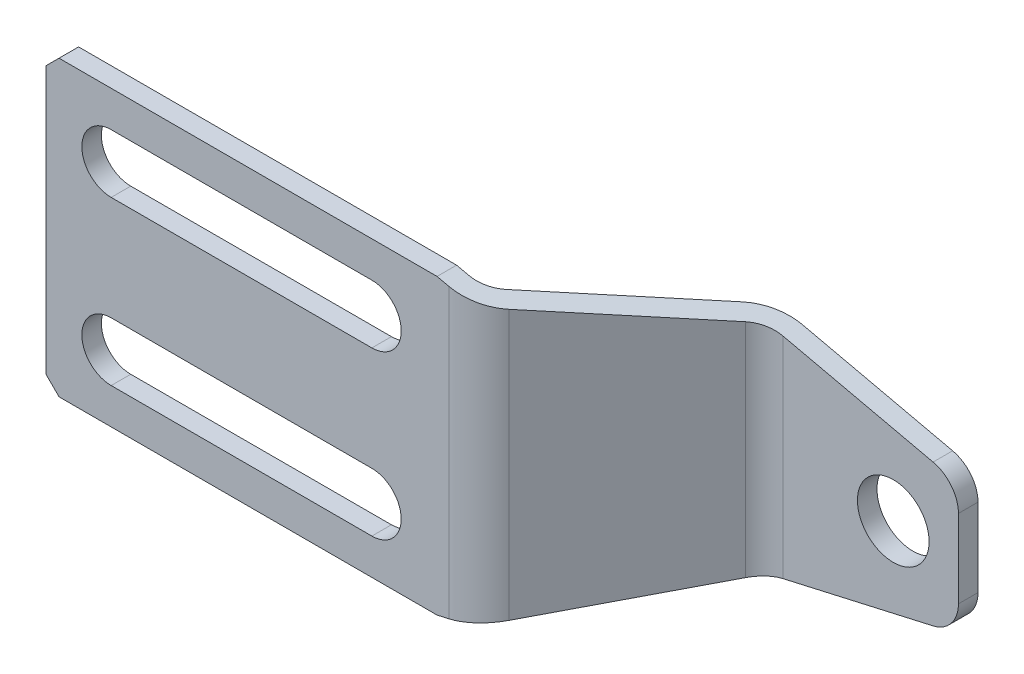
ISO-10303-21;
HEADER;
FILE_DESCRIPTION(('STEP AP214'),'2;1');
FILE_NAME('part.step','',(''),(''),'','','');
FILE_SCHEMA(('AUTOMOTIVE_DESIGN { 1 0 10303 214 1 1 1 1 }'));
ENDSEC;
DATA;
#1=APPLICATION_CONTEXT('core data for automotive mechanical design processes');
#2=APPLICATION_PROTOCOL_DEFINITION('international standard','automotive_design',2000,#1);
#3=PRODUCT_CONTEXT('',#1,'mechanical');
#4=PRODUCT('Part','Part','',(#3));
#5=PRODUCT_RELATED_PRODUCT_CATEGORY('part','',(#4));
#6=PRODUCT_DEFINITION_FORMATION('','',#4);
#7=PRODUCT_DEFINITION_CONTEXT('part definition',#1,'design');
#8=PRODUCT_DEFINITION('design','',#6,#7);
#9=PRODUCT_DEFINITION_SHAPE('','',#8);
#10=(LENGTH_UNIT() NAMED_UNIT(*) SI_UNIT(.MILLI.,.METRE.));
#11=(NAMED_UNIT(*) PLANE_ANGLE_UNIT() SI_UNIT($,.RADIAN.));
#12=(NAMED_UNIT(*) SI_UNIT($,.STERADIAN.) SOLID_ANGLE_UNIT());
#13=UNCERTAINTY_MEASURE_WITH_UNIT(LENGTH_MEASURE(1.E-05),#10,'distance_accuracy_value','');
#14=(GEOMETRIC_REPRESENTATION_CONTEXT(3) GLOBAL_UNCERTAINTY_ASSIGNED_CONTEXT((#13)) GLOBAL_UNIT_ASSIGNED_CONTEXT((#10,
#11,#12)) REPRESENTATION_CONTEXT('',''));
#15=CARTESIAN_POINT('',(0.,0.,0.));
#16=DIRECTION('',(0.,0.,1.));
#17=DIRECTION('',(1.,0.,0.));
#18=AXIS2_PLACEMENT_3D('',#15,#16,#17);
#19=CARTESIAN_POINT('',(95.,12.5000000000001,-75.));
#20=DIRECTION('',(0.,0.,1.));
#21=DIRECTION('',(0.,-1.,0.));
#22=AXIS2_PLACEMENT_3D('',#19,#20,#21);
#23=CYLINDRICAL_SURFACE('',#22,5.5);
#24=CARTESIAN_POINT('',(95.,12.5000000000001,-22.));
#25=DIRECTION('',(0.,0.,-1.));
#26=DIRECTION('',(1.,0.,0.));
#27=AXIS2_PLACEMENT_3D('',#24,#25,#26);
#28=CIRCLE('',#27,5.5);
#29=CARTESIAN_POINT('',(100.5,12.5000000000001,-22.));
#30=VERTEX_POINT('',#29);
#31=EDGE_CURVE('E270',#30,#30,#28,.F.);
#32=ORIENTED_EDGE('',*,*,#31,.T.);
#33=EDGE_LOOP('',(#32));
#34=FACE_BOUND('',#33,.T.);
#35=CARTESIAN_POINT('',(95.,12.5000000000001,-25.));
#36=DIRECTION('',(0.,0.,-1.));
#37=DIRECTION('',(1.,0.,0.));
#38=AXIS2_PLACEMENT_3D('',#35,#36,#37);
#39=CIRCLE('',#38,5.5);
#40=CARTESIAN_POINT('',(100.5,12.5000000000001,-25.));
#41=VERTEX_POINT('',#40);
#42=EDGE_CURVE('E278',#41,#41,#39,.F.);
#43=ORIENTED_EDGE('',*,*,#42,.F.);
#44=EDGE_LOOP('',(#43));
#45=FACE_BOUND('',#44,.T.);
#46=ADVANCED_FACE('F14',(#34,#45),#23,.F.);
#47=CARTESIAN_POINT('',(-10.,52.5,0.));
#48=DIRECTION('',(0.,0.,-1.));
#49=DIRECTION('',(0.,1.,0.));
#50=AXIS2_PLACEMENT_3D('',#47,#48,#49);
#51=PLANE('',#50);
#52=CARTESIAN_POINT('',(40.,25.,0.));
#53=DIRECTION('',(0.,0.,-1.));
#54=DIRECTION('',(0.,1.,0.));
#55=AXIS2_PLACEMENT_3D('',#52,#53,#54);
#56=CIRCLE('',#55,4.5);
#57=CARTESIAN_POINT('',(40.,20.5,0.));
#58=VERTEX_POINT('',#57);
#59=CARTESIAN_POINT('',(40.,29.5,0.));
#60=VERTEX_POINT('',#59);
#61=EDGE_CURVE('E299',#58,#60,#56,.F.);
#62=ORIENTED_EDGE('',*,*,#61,.T.);
#63=DIRECTION('',(-1.,0.,0.));
#64=VECTOR('',#63,1.);
#65=CARTESIAN_POINT('',(40.,29.5,0.));
#66=LINE('',#65,#64);
#67=CARTESIAN_POINT('',(0.,29.5,0.));
#68=VERTEX_POINT('',#67);
#69=EDGE_CURVE('E358',#60,#68,#66,.T.);
#70=ORIENTED_EDGE('',*,*,#69,.T.);
#71=CARTESIAN_POINT('',(0.,25.,0.));
#72=DIRECTION('',(0.,0.,-1.));
#73=DIRECTION('',(0.,1.,0.));
#74=AXIS2_PLACEMENT_3D('',#71,#72,#73);
#75=CIRCLE('',#74,4.5);
#76=CARTESIAN_POINT('',(0.,20.5,0.));
#77=VERTEX_POINT('',#76);
#78=EDGE_CURVE('E295',#68,#77,#75,.F.);
#79=ORIENTED_EDGE('',*,*,#78,.T.);
#80=DIRECTION('',(1.,0.,0.));
#81=VECTOR('',#80,1.);
#82=CARTESIAN_POINT('',(40.,20.5,0.));
#83=LINE('',#82,#81);
#84=EDGE_CURVE('E297',#77,#58,#83,.T.);
#85=ORIENTED_EDGE('',*,*,#84,.T.);
#86=EDGE_LOOP('',(#62,#70,#79,#85));
#87=FACE_BOUND('',#86,.T.);
#88=DIRECTION('',(-1.,0.,0.));
#89=VECTOR('',#88,1.);
#90=CARTESIAN_POINT('',(-8.,35.,0.));
#91=LINE('',#90,#89);
#92=CARTESIAN_POINT('',(50.,35.,0.));
#93=VERTEX_POINT('',#92);
#94=CARTESIAN_POINT('',(-8.,35.,0.));
#95=VERTEX_POINT('',#94);
#96=EDGE_CURVE('E320',#93,#95,#91,.T.);
#97=ORIENTED_EDGE('',*,*,#96,.F.);
#98=DIRECTION('',(-0.97513285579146,0.221621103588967,0.));
#99=VECTOR('',#98,1.);
#100=CARTESIAN_POINT('',(50.,35.,0.));
#101=LINE('',#100,#99);
#102=CARTESIAN_POINT('',(51.8278760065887,34.5845736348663,0.));
#103=VERTEX_POINT('',#102);
#104=EDGE_CURVE('E317',#103,#93,#101,.T.);
#105=ORIENTED_EDGE('',*,*,#104,.F.);
#106=DIRECTION('',(0.,-1.,0.));
#107=VECTOR('',#106,1.);
#108=CARTESIAN_POINT('',(51.8278760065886,52.5,0.));
#109=LINE('',#108,#107);
#110=CARTESIAN_POINT('',(51.8278760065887,-9.58457363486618,0.));
#111=VERTEX_POINT('',#110);
#112=EDGE_CURVE('E281',#103,#111,#109,.T.);
#113=ORIENTED_EDGE('',*,*,#112,.T.);
#114=DIRECTION('',(0.975132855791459,0.221621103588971,0.));
#115=VECTOR('',#114,1.);
#116=CARTESIAN_POINT('',(50.0000000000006,-10.,0.));
#117=LINE('',#116,#115);
#118=CARTESIAN_POINT('',(50.0000000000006,-10.,0.));
#119=VERTEX_POINT('',#118);
#120=EDGE_CURVE('E315',#119,#111,#117,.T.);
#121=ORIENTED_EDGE('',*,*,#120,.F.);
#122=DIRECTION('',(1.,0.,0.));
#123=VECTOR('',#122,1.);
#124=CARTESIAN_POINT('',(-8.,-10.,0.));
#125=LINE('',#124,#123);
#126=CARTESIAN_POINT('',(-8.,-10.,0.));
#127=VERTEX_POINT('',#126);
#128=EDGE_CURVE('E312',#127,#119,#125,.T.);
#129=ORIENTED_EDGE('',*,*,#128,.F.);
#130=DIRECTION('',(0.707106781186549,-0.707106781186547,0.));
#131=VECTOR('',#130,1.);
#132=CARTESIAN_POINT('',(-10.,-8.,0.));
#133=LINE('',#132,#131);
#134=CARTESIAN_POINT('',(-10.,-8.,0.));
#135=VERTEX_POINT('',#134);
#136=EDGE_CURVE('E309',#135,#127,#133,.T.);
#137=ORIENTED_EDGE('',*,*,#136,.F.);
#138=DIRECTION('',(0.,-1.,0.));
#139=VECTOR('',#138,1.);
#140=CARTESIAN_POINT('',(-10.,52.5,0.));
#141=LINE('',#140,#139);
#142=CARTESIAN_POINT('',(-10.,33.,0.));
#143=VERTEX_POINT('',#142);
#144=EDGE_CURVE('E275',#143,#135,#141,.T.);
#145=ORIENTED_EDGE('',*,*,#144,.F.);
#146=DIRECTION('',(-0.707106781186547,-0.707106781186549,0.));
#147=VECTOR('',#146,1.);
#148=CARTESIAN_POINT('',(-8.,35.,0.));
#149=LINE('',#148,#147);
#150=EDGE_CURVE('E323',#95,#143,#149,.T.);
#151=ORIENTED_EDGE('',*,*,#150,.F.);
#152=EDGE_LOOP('',(#97,#105,#113,#121,#129,#137,#145,#151));
#153=FACE_BOUND('',#152,.T.);
#154=CARTESIAN_POINT('',(40.,0.,0.));
#155=DIRECTION('',(0.,0.,-1.));
#156=DIRECTION('',(0.,1.,0.));
#157=AXIS2_PLACEMENT_3D('',#154,#155,#156);
#158=CIRCLE('',#157,4.5);
#159=CARTESIAN_POINT('',(40.,-4.49999999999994,0.));
#160=VERTEX_POINT('',#159);
#161=CARTESIAN_POINT('',(40.,4.50000000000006,0.));
#162=VERTEX_POINT('',#161);
#163=EDGE_CURVE('E307',#160,#162,#158,.F.);
#164=ORIENTED_EDGE('',*,*,#163,.T.);
#165=DIRECTION('',(-1.,0.,0.));
#166=VECTOR('',#165,1.);
#167=CARTESIAN_POINT('',(40.,4.50000000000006,0.));
#168=LINE('',#167,#166);
#169=CARTESIAN_POINT('',(0.,4.5,0.));
#170=VERTEX_POINT('',#169);
#171=EDGE_CURVE('E301',#162,#170,#168,.T.);
#172=ORIENTED_EDGE('',*,*,#171,.T.);
#173=CARTESIAN_POINT('',(0.,0.,0.));
#174=DIRECTION('',(0.,0.,-1.));
#175=DIRECTION('',(0.,1.,0.));
#176=AXIS2_PLACEMENT_3D('',#173,#174,#175);
#177=CIRCLE('',#176,4.5);
#178=CARTESIAN_POINT('',(0.,-4.5,0.));
#179=VERTEX_POINT('',#178);
#180=EDGE_CURVE('E303',#170,#179,#177,.F.);
#181=ORIENTED_EDGE('',*,*,#180,.T.);
#182=DIRECTION('',(1.,0.,0.));
#183=VECTOR('',#182,1.);
#184=CARTESIAN_POINT('',(40.,-4.49999999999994,0.));
#185=LINE('',#184,#183);
#186=EDGE_CURVE('E305',#179,#160,#185,.T.);
#187=ORIENTED_EDGE('',*,*,#186,.T.);
#188=EDGE_LOOP('',(#164,#172,#181,#187));
#189=FACE_BOUND('',#188,.T.);
#190=ADVANCED_FACE('F447',(#87,#153,#189),#51,.T.);
#191=CARTESIAN_POINT('',(51.8278760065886,52.5,-5.));
#192=DIRECTION('',(0.,-1.,0.));
#193=DIRECTION('',(0.,0.,-1.));
#194=AXIS2_PLACEMENT_3D('',#191,#192,#193);
#195=CYLINDRICAL_SURFACE('',#194,5.);
#196=DIRECTION('',(0.,-1.,0.));
#197=VECTOR('',#196,1.);
#198=CARTESIAN_POINT('',(55.7322200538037,52.5,-1.8765247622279));
#199=LINE('',#198,#197);
#200=CARTESIAN_POINT('',(55.7322200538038,33.6972227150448,-1.8765247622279));
#201=VERTEX_POINT('',#200);
#202=CARTESIAN_POINT('',(55.7322200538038,-8.69722271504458,-1.8765247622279));
#203=VERTEX_POINT('',#202);
#204=EDGE_CURVE('E279',#201,#203,#199,.T.);
#205=ORIENTED_EDGE('',*,*,#204,.T.);
#206=CARTESIAN_POINT('',(51.8278760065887,-9.58457363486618,-5.));
#207=DIRECTION('',(0.221621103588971,-0.97513285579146,0.));
#208=DIRECTION('',(-0.975132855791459,-0.221621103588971,0.));
#209=AXIS2_PLACEMENT_3D('',#206,#207,#208);
#210=ELLIPSE('',#209,5.12750644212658,5.);
#211=EDGE_CURVE('E193',#111,#203,#210,.F.);
#212=ORIENTED_EDGE('',*,*,#211,.F.);
#213=ORIENTED_EDGE('',*,*,#112,.F.);
#214=CARTESIAN_POINT('',(51.8278760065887,34.5845736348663,-5.));
#215=DIRECTION('',(0.221621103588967,0.97513285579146,0.));
#216=DIRECTION('',(0.97513285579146,-0.221621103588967,0.));
#217=AXIS2_PLACEMENT_3D('',#214,#215,#216);
#218=ELLIPSE('',#217,5.12750644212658,5.);
#219=EDGE_CURVE('E326',#201,#103,#218,.F.);
#220=ORIENTED_EDGE('',*,*,#219,.F.);
#221=EDGE_LOOP('',(#205,#212,#213,#220));
#222=FACE_BOUND('',#221,.T.);
#223=ADVANCED_FACE('F454',(#222),#195,.F.);
#224=CARTESIAN_POINT('',(71.7689997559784,52.5,-21.9224993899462));
#225=DIRECTION('',(-0.78086880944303,0.,-0.624695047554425));
#226=DIRECTION('',(0.624695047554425,0.,-0.78086880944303));
#227=AXIS2_PLACEMENT_3D('',#224,#225,#226);
#228=PLANE('',#227);
#229=DIRECTION('',(0.,-1.,0.));
#230=VECTOR('',#229,1.);
#231=CARTESIAN_POINT('',(71.8290485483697,35.,-21.9975603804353));
#232=LINE('',#231,#230);
#233=CARTESIAN_POINT('',(71.8290485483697,30.0388526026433,-21.9975603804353));
#234=VERTEX_POINT('',#233);
#235=CARTESIAN_POINT('',(71.8290485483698,-5.03885260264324,-21.9975603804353));
#236=VERTEX_POINT('',#235);
#237=EDGE_CURVE('E203',#234,#236,#232,.T.);
#238=ORIENTED_EDGE('',*,*,#237,.T.);
#239=DIRECTION('',(0.618492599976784,0.140566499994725,-0.77311574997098));
#240=VECTOR('',#239,1.);
#241=CARTESIAN_POINT('',(88.3913803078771,-1.27468629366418,-42.7004750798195));
#242=LINE('',#241,#240);
#243=EDGE_CURVE('E187',#203,#236,#242,.T.);
#244=ORIENTED_EDGE('',*,*,#243,.F.);
#245=ORIENTED_EDGE('',*,*,#204,.F.);
#246=DIRECTION('',(-0.618492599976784,0.140566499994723,0.77311574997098));
#247=VECTOR('',#246,1.);
#248=CARTESIAN_POINT('',(88.3913803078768,26.2746862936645,-42.7004750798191));
#249=LINE('',#248,#247);
#250=EDGE_CURVE('E208',#234,#201,#249,.T.);
#251=ORIENTED_EDGE('',*,*,#250,.F.);
#252=EDGE_LOOP('',(#238,#244,#245,#251));
#253=FACE_BOUND('',#252,.T.);
#254=ADVANCED_FACE('F207',(#253),#228,.T.);
#255=CARTESIAN_POINT('',(78.1721239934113,52.5,-25.));
#256=DIRECTION('',(0.,0.,-1.));
#257=DIRECTION('',(1.,0.,0.));
#258=AXIS2_PLACEMENT_3D('',#255,#256,#257);
#259=PLANE('',#258);
#260=DIRECTION('',(0.975132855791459,0.221621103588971,0.));
#261=VECTOR('',#260,1.);
#262=CARTESIAN_POINT('',(50.0000000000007,-10.,-25.));
#263=LINE('',#262,#261);
#264=CARTESIAN_POINT('',(78.0759990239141,-3.61909113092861,-25.));
#265=VERTEX_POINT('',#264);
#266=CARTESIAN_POINT('',(101.108105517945,1.61547852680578,-25.));
#267=VERTEX_POINT('',#266);
#268=EDGE_CURVE('E286',#265,#267,#263,.T.);
#269=ORIENTED_EDGE('',*,*,#268,.F.);
#270=DIRECTION('',(0.,-1.,0.));
#271=VECTOR('',#270,1.);
#272=CARTESIAN_POINT('',(78.075999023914,35.,-25.));
#273=LINE('',#272,#271);
#274=CARTESIAN_POINT('',(78.075999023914,28.6190911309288,-25.));
#275=VERTEX_POINT('',#274);
#276=EDGE_CURVE('E205',#275,#265,#273,.T.);
#277=ORIENTED_EDGE('',*,*,#276,.F.);
#278=DIRECTION('',(-0.97513285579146,0.221621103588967,0.));
#279=VECTOR('',#278,1.);
#280=CARTESIAN_POINT('',(50.,35.,-25.));
#281=LINE('',#280,#279);
#282=CARTESIAN_POINT('',(101.108105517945,23.3845214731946,-25.));
#283=VERTEX_POINT('',#282);
#284=EDGE_CURVE('E28',#283,#275,#281,.T.);
#285=ORIENTED_EDGE('',*,*,#284,.F.);
#286=CARTESIAN_POINT('',(100.,18.5088571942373,-25.));
#287=DIRECTION('',(0.,0.,-1.));
#288=DIRECTION('',(1.,0.,0.));
#289=AXIS2_PLACEMENT_3D('',#286,#287,#288);
#290=CIRCLE('',#289,5.);
#291=CARTESIAN_POINT('',(105.,18.5088571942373,-25.));
#292=VERTEX_POINT('',#291);
#293=EDGE_CURVE('E291',#292,#283,#290,.F.);
#294=ORIENTED_EDGE('',*,*,#293,.F.);
#295=DIRECTION('',(0.,-1.,0.));
#296=VECTOR('',#295,1.);
#297=CARTESIAN_POINT('',(105.,52.5,-25.));
#298=LINE('',#297,#296);
#299=CARTESIAN_POINT('',(105.,6.49114280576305,-25.));
#300=VERTEX_POINT('',#299);
#301=EDGE_CURVE('E276',#292,#300,#298,.T.);
#302=ORIENTED_EDGE('',*,*,#301,.T.);
#303=CARTESIAN_POINT('',(100.,6.49114280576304,-25.));
#304=DIRECTION('',(0.,0.,-1.));
#305=DIRECTION('',(1.,0.,0.));
#306=AXIS2_PLACEMENT_3D('',#303,#304,#305);
#307=CIRCLE('',#306,5.);
#308=EDGE_CURVE('E288',#267,#300,#307,.F.);
#309=ORIENTED_EDGE('',*,*,#308,.F.);
#310=EDGE_LOOP('',(#269,#277,#285,#294,#302,#309));
#311=FACE_BOUND('',#310,.T.);
#312=ORIENTED_EDGE('',*,*,#42,.T.);
#313=EDGE_LOOP('',(#312));
#314=FACE_BOUND('',#313,.T.);
#315=ADVANCED_FACE('F425',(#311,#314),#259,.T.);
#316=CARTESIAN_POINT('',(40.,29.5,-75.));
#317=DIRECTION('',(0.,1.,0.));
#318=DIRECTION('',(0.,0.,1.));
#319=AXIS2_PLACEMENT_3D('',#316,#317,#318);
#320=PLANE('',#319);
#321=DIRECTION('',(0.,0.,1.));
#322=VECTOR('',#321,1.);
#323=CARTESIAN_POINT('',(40.,29.5,-75.));
#324=LINE('',#323,#322);
#325=CARTESIAN_POINT('',(40.,29.5,3.));
#326=VERTEX_POINT('',#325);
#327=EDGE_CURVE('E330',#60,#326,#324,.T.);
#328=ORIENTED_EDGE('',*,*,#327,.T.);
#329=DIRECTION('',(-1.,0.,0.));
#330=VECTOR('',#329,1.);
#331=CARTESIAN_POINT('',(40.,29.5,3.));
#332=LINE('',#331,#330);
#333=CARTESIAN_POINT('',(0.,29.5,3.));
#334=VERTEX_POINT('',#333);
#335=EDGE_CURVE('E36',#326,#334,#332,.T.);
#336=ORIENTED_EDGE('',*,*,#335,.T.);
#337=DIRECTION('',(0.,0.,1.));
#338=VECTOR('',#337,1.);
#339=CARTESIAN_POINT('',(0.,29.5,-75.));
#340=LINE('',#339,#338);
#341=EDGE_CURVE('E338',#68,#334,#340,.T.);
#342=ORIENTED_EDGE('',*,*,#341,.F.);
#343=ORIENTED_EDGE('',*,*,#69,.F.);
#344=EDGE_LOOP('',(#328,#336,#342,#343));
#345=FACE_BOUND('',#344,.T.);
#346=ADVANCED_FACE('F468',(#345),#320,.F.);
#347=CARTESIAN_POINT('',(0.,25.,-75.));
#348=DIRECTION('',(0.,0.,1.));
#349=DIRECTION('',(0.,-1.,0.));
#350=AXIS2_PLACEMENT_3D('',#347,#348,#349);
#351=CYLINDRICAL_SURFACE('',#350,4.5);
#352=ORIENTED_EDGE('',*,*,#341,.T.);
#353=CARTESIAN_POINT('',(0.,25.,3.));
#354=DIRECTION('',(0.,0.,-1.));
#355=DIRECTION('',(1.,0.,0.));
#356=AXIS2_PLACEMENT_3D('',#353,#354,#355);
#357=CIRCLE('',#356,4.5);
#358=CARTESIAN_POINT('',(0.,20.5,3.));
#359=VERTEX_POINT('',#358);
#360=EDGE_CURVE('E254',#334,#359,#357,.F.);
#361=ORIENTED_EDGE('',*,*,#360,.T.);
#362=DIRECTION('',(0.,0.,1.));
#363=VECTOR('',#362,1.);
#364=CARTESIAN_POINT('',(0.,20.5,-75.));
#365=LINE('',#364,#363);
#366=EDGE_CURVE('E335',#77,#359,#365,.T.);
#367=ORIENTED_EDGE('',*,*,#366,.F.);
#368=ORIENTED_EDGE('',*,*,#78,.F.);
#369=EDGE_LOOP('',(#352,#361,#367,#368));
#370=FACE_BOUND('',#369,.T.);
#371=ADVANCED_FACE('F464',(#370),#351,.F.);
#372=CARTESIAN_POINT('',(40.,20.5,-75.));
#373=DIRECTION('',(0.,-1.,0.));
#374=DIRECTION('',(0.,0.,-1.));
#375=AXIS2_PLACEMENT_3D('',#372,#373,#374);
#376=PLANE('',#375);
#377=ORIENTED_EDGE('',*,*,#366,.T.);
#378=DIRECTION('',(1.,0.,0.));
#379=VECTOR('',#378,1.);
#380=CARTESIAN_POINT('',(40.,20.5,3.));
#381=LINE('',#380,#379);
#382=CARTESIAN_POINT('',(40.,20.5,3.));
#383=VERTEX_POINT('',#382);
#384=EDGE_CURVE('E251',#359,#383,#381,.T.);
#385=ORIENTED_EDGE('',*,*,#384,.T.);
#386=DIRECTION('',(0.,0.,1.));
#387=VECTOR('',#386,1.);
#388=CARTESIAN_POINT('',(40.,20.5,-75.));
#389=LINE('',#388,#387);
#390=EDGE_CURVE('E331',#58,#383,#389,.T.);
#391=ORIENTED_EDGE('',*,*,#390,.F.);
#392=ORIENTED_EDGE('',*,*,#84,.F.);
#393=EDGE_LOOP('',(#377,#385,#391,#392));
#394=FACE_BOUND('',#393,.T.);
#395=ADVANCED_FACE('F460',(#394),#376,.F.);
#396=CARTESIAN_POINT('',(40.,25.,-75.));
#397=DIRECTION('',(0.,0.,1.));
#398=DIRECTION('',(0.,-1.,0.));
#399=AXIS2_PLACEMENT_3D('',#396,#397,#398);
#400=CYLINDRICAL_SURFACE('',#399,4.5);
#401=ORIENTED_EDGE('',*,*,#390,.T.);
#402=CARTESIAN_POINT('',(40.,25.,3.));
#403=DIRECTION('',(0.,0.,-1.));
#404=DIRECTION('',(1.,0.,0.));
#405=AXIS2_PLACEMENT_3D('',#402,#403,#404);
#406=CIRCLE('',#405,4.5);
#407=EDGE_CURVE('E249',#383,#326,#406,.F.);
#408=ORIENTED_EDGE('',*,*,#407,.T.);
#409=ORIENTED_EDGE('',*,*,#327,.F.);
#410=ORIENTED_EDGE('',*,*,#61,.F.);
#411=EDGE_LOOP('',(#401,#408,#409,#410));
#412=FACE_BOUND('',#411,.T.);
#413=ADVANCED_FACE('F463',(#412),#400,.F.);
#414=CARTESIAN_POINT('',(40.,4.50000000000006,-75.));
#415=DIRECTION('',(0.,1.,0.));
#416=DIRECTION('',(0.,0.,1.));
#417=AXIS2_PLACEMENT_3D('',#414,#415,#416);
#418=PLANE('',#417);
#419=DIRECTION('',(0.,0.,1.));
#420=VECTOR('',#419,1.);
#421=CARTESIAN_POINT('',(40.,4.50000000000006,-75.));
#422=LINE('',#421,#420);
#423=CARTESIAN_POINT('',(40.,4.50000000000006,3.));
#424=VERTEX_POINT('',#423);
#425=EDGE_CURVE('E334',#162,#424,#422,.T.);
#426=ORIENTED_EDGE('',*,*,#425,.T.);
#427=DIRECTION('',(-1.,0.,0.));
#428=VECTOR('',#427,1.);
#429=CARTESIAN_POINT('',(40.,4.50000000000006,3.));
#430=LINE('',#429,#428);
#431=CARTESIAN_POINT('',(0.,4.5,3.));
#432=VERTEX_POINT('',#431);
#433=EDGE_CURVE('E246',#424,#432,#430,.T.);
#434=ORIENTED_EDGE('',*,*,#433,.T.);
#435=DIRECTION('',(0.,0.,1.));
#436=VECTOR('',#435,1.);
#437=CARTESIAN_POINT('',(0.,4.5,-75.));
#438=LINE('',#437,#436);
#439=EDGE_CURVE('E350',#170,#432,#438,.T.);
#440=ORIENTED_EDGE('',*,*,#439,.F.);
#441=ORIENTED_EDGE('',*,*,#171,.F.);
#442=EDGE_LOOP('',(#426,#434,#440,#441));
#443=FACE_BOUND('',#442,.T.);
#444=ADVANCED_FACE('F475',(#443),#418,.F.);
#445=CARTESIAN_POINT('',(0.,0.,-75.));
#446=DIRECTION('',(0.,0.,1.));
#447=DIRECTION('',(0.,-1.,0.));
#448=AXIS2_PLACEMENT_3D('',#445,#446,#447);
#449=CYLINDRICAL_SURFACE('',#448,4.5);
#450=ORIENTED_EDGE('',*,*,#439,.T.);
#451=CARTESIAN_POINT('',(0.,0.,3.));
#452=DIRECTION('',(0.,0.,-1.));
#453=DIRECTION('',(1.,0.,0.));
#454=AXIS2_PLACEMENT_3D('',#451,#452,#453);
#455=CIRCLE('',#454,4.5);
#456=CARTESIAN_POINT('',(0.,-4.5,3.));
#457=VERTEX_POINT('',#456);
#458=EDGE_CURVE('E243',#432,#457,#455,.F.);
#459=ORIENTED_EDGE('',*,*,#458,.T.);
#460=DIRECTION('',(0.,0.,1.));
#461=VECTOR('',#460,1.);
#462=CARTESIAN_POINT('',(0.,-4.5,-75.));
#463=LINE('',#462,#461);
#464=EDGE_CURVE('E347',#179,#457,#463,.T.);
#465=ORIENTED_EDGE('',*,*,#464,.F.);
#466=ORIENTED_EDGE('',*,*,#180,.F.);
#467=EDGE_LOOP('',(#450,#459,#465,#466));
#468=FACE_BOUND('',#467,.T.);
#469=ADVANCED_FACE('F481',(#468),#449,.F.);
#470=CARTESIAN_POINT('',(40.,-4.49999999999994,-75.));
#471=DIRECTION('',(0.,-1.,0.));
#472=DIRECTION('',(0.,0.,-1.));
#473=AXIS2_PLACEMENT_3D('',#470,#471,#472);
#474=PLANE('',#473);
#475=ORIENTED_EDGE('',*,*,#464,.T.);
#476=DIRECTION('',(1.,0.,0.));
#477=VECTOR('',#476,1.);
#478=CARTESIAN_POINT('',(40.,-4.49999999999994,3.));
#479=LINE('',#478,#477);
#480=CARTESIAN_POINT('',(40.,-4.49999999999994,3.));
#481=VERTEX_POINT('',#480);
#482=EDGE_CURVE('E240',#457,#481,#479,.T.);
#483=ORIENTED_EDGE('',*,*,#482,.T.);
#484=DIRECTION('',(0.,0.,1.));
#485=VECTOR('',#484,1.);
#486=CARTESIAN_POINT('',(40.,-4.49999999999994,-75.));
#487=LINE('',#486,#485);
#488=EDGE_CURVE('E343',#160,#481,#487,.T.);
#489=ORIENTED_EDGE('',*,*,#488,.F.);
#490=ORIENTED_EDGE('',*,*,#186,.F.);
#491=EDGE_LOOP('',(#475,#483,#489,#490));
#492=FACE_BOUND('',#491,.T.);
#493=ADVANCED_FACE('F477',(#492),#474,.F.);
#494=CARTESIAN_POINT('',(40.,0.,-75.));
#495=DIRECTION('',(0.,0.,1.));
#496=DIRECTION('',(0.,-1.,0.));
#497=AXIS2_PLACEMENT_3D('',#494,#495,#496);
#498=CYLINDRICAL_SURFACE('',#497,4.5);
#499=ORIENTED_EDGE('',*,*,#488,.T.);
#500=CARTESIAN_POINT('',(40.,0.,3.));
#501=DIRECTION('',(0.,0.,-1.));
#502=DIRECTION('',(1.,0.,0.));
#503=AXIS2_PLACEMENT_3D('',#500,#501,#502);
#504=CIRCLE('',#503,4.5);
#505=EDGE_CURVE('E237',#481,#424,#504,.F.);
#506=ORIENTED_EDGE('',*,*,#505,.T.);
#507=ORIENTED_EDGE('',*,*,#425,.F.);
#508=ORIENTED_EDGE('',*,*,#163,.F.);
#509=EDGE_LOOP('',(#499,#506,#507,#508));
#510=FACE_BOUND('',#509,.T.);
#511=ADVANCED_FACE('F480',(#510),#498,.F.);
#512=CARTESIAN_POINT('',(-8.,35.,-75.));
#513=DIRECTION('',(-0.707106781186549,0.707106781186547,0.));
#514=DIRECTION('',(-0.707106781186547,-0.707106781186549,0.));
#515=AXIS2_PLACEMENT_3D('',#512,#513,#514);
#516=PLANE('',#515);
#517=DIRECTION('',(-0.707106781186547,-0.707106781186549,0.));
#518=VECTOR('',#517,1.);
#519=CARTESIAN_POINT('',(-8.,35.,3.));
#520=LINE('',#519,#518);
#521=CARTESIAN_POINT('',(-8.,35.,3.));
#522=VERTEX_POINT('',#521);
#523=CARTESIAN_POINT('',(-10.,33.,3.));
#524=VERTEX_POINT('',#523);
#525=EDGE_CURVE('E231',#522,#524,#520,.T.);
#526=ORIENTED_EDGE('',*,*,#525,.F.);
#527=DIRECTION('',(0.,0.,1.));
#528=VECTOR('',#527,1.);
#529=CARTESIAN_POINT('',(-8.,35.,-75.));
#530=LINE('',#529,#528);
#531=EDGE_CURVE('E355',#95,#522,#530,.T.);
#532=ORIENTED_EDGE('',*,*,#531,.F.);
#533=ORIENTED_EDGE('',*,*,#150,.T.);
#534=DIRECTION('',(0.,0.,1.));
#535=VECTOR('',#534,1.);
#536=CARTESIAN_POINT('',(-10.,33.,-75.));
#537=LINE('',#536,#535);
#538=EDGE_CURVE('E346',#143,#524,#537,.T.);
#539=ORIENTED_EDGE('',*,*,#538,.T.);
#540=EDGE_LOOP('',(#526,#532,#533,#539));
#541=FACE_BOUND('',#540,.T.);
#542=ADVANCED_FACE('F16',(#541),#516,.T.);
#543=CARTESIAN_POINT('',(-8.,35.,-75.));
#544=DIRECTION('',(0.,1.,0.));
#545=DIRECTION('',(-1.,0.,0.));
#546=AXIS2_PLACEMENT_3D('',#543,#544,#545);
#547=PLANE('',#546);
#548=DIRECTION('',(1.,0.,0.));
#549=VECTOR('',#548,1.);
#550=CARTESIAN_POINT('',(51.8278760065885,35.,3.));
#551=LINE('',#550,#549);
#552=CARTESIAN_POINT('',(49.9999999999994,35.,3.));
#553=VERTEX_POINT('',#552);
#554=EDGE_CURVE('E211',#522,#553,#551,.T.);
#555=ORIENTED_EDGE('',*,*,#554,.T.);
#556=DIRECTION('',(0.,0.,1.));
#557=VECTOR('',#556,1.);
#558=CARTESIAN_POINT('',(50.,35.,-75.));
#559=LINE('',#558,#557);
#560=EDGE_CURVE('E359',#93,#553,#559,.T.);
#561=ORIENTED_EDGE('',*,*,#560,.F.);
#562=ORIENTED_EDGE('',*,*,#96,.T.);
#563=ORIENTED_EDGE('',*,*,#531,.T.);
#564=EDGE_LOOP('',(#555,#561,#562,#563));
#565=FACE_BOUND('',#564,.T.);
#566=ADVANCED_FACE('F492',(#565),#547,.T.);
#567=CARTESIAN_POINT('',(50.,35.,-75.));
#568=DIRECTION('',(0.221621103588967,0.97513285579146,0.));
#569=DIRECTION('',(-0.97513285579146,0.221621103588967,0.));
#570=AXIS2_PLACEMENT_3D('',#567,#568,#569);
#571=PLANE('',#570);
#572=CARTESIAN_POINT('',(51.8278760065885,34.5845736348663,-5.));
#573=DIRECTION('',(0.221621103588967,0.97513285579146,0.));
#574=DIRECTION('',(0.97513285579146,-0.221621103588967,0.));
#575=AXIS2_PLACEMENT_3D('',#572,#573,#574);
#576=ELLIPSE('',#575,8.20401030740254,8.);
#577=CARTESIAN_POINT('',(58.0748264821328,33.1648121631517,-0.0024396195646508));
#578=VERTEX_POINT('',#577);
#579=CARTESIAN_POINT('',(51.8278760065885,34.5845736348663,3.));
#580=VERTEX_POINT('',#579);
#581=EDGE_CURVE('E273',#578,#580,#576,.F.);
#582=ORIENTED_EDGE('',*,*,#581,.F.);
#583=DIRECTION('',(-0.618492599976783,0.140566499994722,0.773115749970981));
#584=VECTOR('',#583,1.);
#585=CARTESIAN_POINT('',(90.6876993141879,25.7527956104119,-40.7685306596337));
#586=LINE('',#585,#584);
#587=CARTESIAN_POINT('',(74.1716549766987,29.5064420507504,-20.1234752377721));
#588=VERTEX_POINT('',#587);
#589=EDGE_CURVE('E258',#588,#578,#586,.T.);
#590=ORIENTED_EDGE('',*,*,#589,.F.);
#591=CARTESIAN_POINT('',(78.0759990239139,28.6190911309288,-17.));
#592=DIRECTION('',(0.221621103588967,0.97513285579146,0.));
#593=DIRECTION('',(0.97513285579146,-0.221621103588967,0.));
#594=AXIS2_PLACEMENT_3D('',#591,#592,#593);
#595=ELLIPSE('',#594,5.12750644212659,5.);
#596=CARTESIAN_POINT('',(78.0759990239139,28.6190911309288,-22.));
#597=VERTEX_POINT('',#596);
#598=EDGE_CURVE('E260',#597,#588,#595,.T.);
#599=ORIENTED_EDGE('',*,*,#598,.F.);
#600=DIRECTION('',(-0.97513285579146,0.221621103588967,0.));
#601=VECTOR('',#600,1.);
#602=CARTESIAN_POINT('',(50.,35.,-22.));
#603=LINE('',#602,#601);
#604=CARTESIAN_POINT('',(101.108105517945,23.3845214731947,-22.));
#605=VERTEX_POINT('',#604);
#606=EDGE_CURVE('E268',#605,#597,#603,.T.);
#607=ORIENTED_EDGE('',*,*,#606,.F.);
#608=DIRECTION('',(0.,0.,1.));
#609=VECTOR('',#608,1.);
#610=CARTESIAN_POINT('',(101.108105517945,23.3845214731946,-75.));
#611=LINE('',#610,#609);
#612=EDGE_CURVE('E362',#283,#605,#611,.T.);
#613=ORIENTED_EDGE('',*,*,#612,.F.);
#614=ORIENTED_EDGE('',*,*,#284,.T.);
#615=CARTESIAN_POINT('',(78.075999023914,28.6190911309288,-17.));
#616=DIRECTION('',(-0.221621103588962,-0.975132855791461,0.));
#617=DIRECTION('',(0.975132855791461,-0.221621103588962,0.));
#618=AXIS2_PLACEMENT_3D('',#615,#616,#617);
#619=ELLIPSE('',#618,8.20401030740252,8.);
#620=EDGE_CURVE('E9',#275,#234,#619,.F.);
#621=ORIENTED_EDGE('',*,*,#620,.T.);
#622=ORIENTED_EDGE('',*,*,#250,.T.);
#623=ORIENTED_EDGE('',*,*,#219,.T.);
#624=ORIENTED_EDGE('',*,*,#104,.T.);
#625=ORIENTED_EDGE('',*,*,#560,.T.);
#626=DIRECTION('',(-0.97513285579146,0.221621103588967,0.));
#627=VECTOR('',#626,1.);
#628=CARTESIAN_POINT('',(50.,35.,3.));
#629=LINE('',#628,#627);
#630=EDGE_CURVE('E235',#580,#553,#629,.T.);
#631=ORIENTED_EDGE('',*,*,#630,.F.);
#632=EDGE_LOOP('',(#582,#590,#599,#607,#613,#614,#621,#622,#623,#624,#625,#631));
#633=FACE_BOUND('',#632,.T.);
#634=ADVANCED_FACE('F419',(#633),#571,.T.);
#635=CARTESIAN_POINT('',(100.,18.5088571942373,-75.));
#636=DIRECTION('',(0.,0.,1.));
#637=DIRECTION('',(0.,-1.,0.));
#638=AXIS2_PLACEMENT_3D('',#635,#636,#637);
#639=CYLINDRICAL_SURFACE('',#638,5.);
#640=CARTESIAN_POINT('',(100.,18.5088571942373,-22.));
#641=DIRECTION('',(0.,0.,-1.));
#642=DIRECTION('',(1.,0.,0.));
#643=AXIS2_PLACEMENT_3D('',#640,#641,#642);
#644=CIRCLE('',#643,5.);
#645=CARTESIAN_POINT('',(105.,18.5088571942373,-22.));
#646=VERTEX_POINT('',#645);
#647=EDGE_CURVE('E266',#646,#605,#644,.F.);
#648=ORIENTED_EDGE('',*,*,#647,.F.);
#649=DIRECTION('',(0.,0.,1.));
#650=VECTOR('',#649,1.);
#651=CARTESIAN_POINT('',(105.,18.5088571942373,-75.));
#652=LINE('',#651,#650);
#653=EDGE_CURVE('E365',#292,#646,#652,.T.);
#654=ORIENTED_EDGE('',*,*,#653,.F.);
#655=ORIENTED_EDGE('',*,*,#293,.T.);
#656=ORIENTED_EDGE('',*,*,#612,.T.);
#657=EDGE_LOOP('',(#648,#654,#655,#656));
#658=FACE_BOUND('',#657,.T.);
#659=ADVANCED_FACE('F421',(#658),#639,.T.);
#660=CARTESIAN_POINT('',(105.,18.5088571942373,-75.));
#661=DIRECTION('',(1.,0.,0.));
#662=DIRECTION('',(0.,1.,0.));
#663=AXIS2_PLACEMENT_3D('',#660,#661,#662);
#664=PLANE('',#663);
#665=DIRECTION('',(0.,1.,0.));
#666=VECTOR('',#665,1.);
#667=CARTESIAN_POINT('',(105.,18.5088571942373,-22.));
#668=LINE('',#667,#666);
#669=CARTESIAN_POINT('',(105.,6.49114280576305,-22.));
#670=VERTEX_POINT('',#669);
#671=EDGE_CURVE('E264',#670,#646,#668,.T.);
#672=ORIENTED_EDGE('',*,*,#671,.F.);
#673=DIRECTION('',(0.,0.,1.));
#674=VECTOR('',#673,1.);
#675=CARTESIAN_POINT('',(105.,6.49114280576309,-75.));
#676=LINE('',#675,#674);
#677=EDGE_CURVE('E368',#300,#670,#676,.T.);
#678=ORIENTED_EDGE('',*,*,#677,.F.);
#679=ORIENTED_EDGE('',*,*,#301,.F.);
#680=ORIENTED_EDGE('',*,*,#653,.T.);
#681=EDGE_LOOP('',(#672,#678,#679,#680));
#682=FACE_BOUND('',#681,.T.);
#683=ADVANCED_FACE('F431',(#682),#664,.T.);
#684=CARTESIAN_POINT('',(100.,6.49114280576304,-75.));
#685=DIRECTION('',(0.,0.,1.));
#686=DIRECTION('',(0.,-1.,0.));
#687=AXIS2_PLACEMENT_3D('',#684,#685,#686);
#688=CYLINDRICAL_SURFACE('',#687,5.);
#689=CARTESIAN_POINT('',(100.,6.49114280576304,-22.));
#690=DIRECTION('',(0.,0.,-1.));
#691=DIRECTION('',(1.,0.,0.));
#692=AXIS2_PLACEMENT_3D('',#689,#690,#691);
#693=CIRCLE('',#692,5.);
#694=CARTESIAN_POINT('',(101.108105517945,1.61547852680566,-22.));
#695=VERTEX_POINT('',#694);
#696=EDGE_CURVE('E262',#695,#670,#693,.F.);
#697=ORIENTED_EDGE('',*,*,#696,.F.);
#698=DIRECTION('',(0.,0.,1.));
#699=VECTOR('',#698,1.);
#700=CARTESIAN_POINT('',(101.108105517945,1.61547852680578,-75.));
#701=LINE('',#700,#699);
#702=EDGE_CURVE('E371',#267,#695,#701,.T.);
#703=ORIENTED_EDGE('',*,*,#702,.F.);
#704=ORIENTED_EDGE('',*,*,#308,.T.);
#705=ORIENTED_EDGE('',*,*,#677,.T.);
#706=EDGE_LOOP('',(#697,#703,#704,#705));
#707=FACE_BOUND('',#706,.T.);
#708=ADVANCED_FACE('F433',(#707),#688,.T.);
#709=CARTESIAN_POINT('',(50.0000000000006,-10.,-75.));
#710=DIRECTION('',(0.221621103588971,-0.97513285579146,0.));
#711=DIRECTION('',(0.975132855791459,0.221621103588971,0.));
#712=AXIS2_PLACEMENT_3D('',#709,#710,#711);
#713=PLANE('',#712);
#714=ORIENTED_EDGE('',*,*,#243,.T.);
#715=CARTESIAN_POINT('',(78.0759990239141,-3.61909113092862,-17.));
#716=DIRECTION('',(-0.221621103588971,0.975132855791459,0.));
#717=DIRECTION('',(-0.975132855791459,-0.221621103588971,0.));
#718=AXIS2_PLACEMENT_3D('',#715,#716,#717);
#719=ELLIPSE('',#718,8.20401030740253,8.);
#720=EDGE_CURVE('E190',#236,#265,#719,.F.);
#721=ORIENTED_EDGE('',*,*,#720,.T.);
#722=ORIENTED_EDGE('',*,*,#268,.T.);
#723=ORIENTED_EDGE('',*,*,#702,.T.);
#724=DIRECTION('',(0.975132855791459,0.221621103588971,0.));
#725=VECTOR('',#724,1.);
#726=CARTESIAN_POINT('',(50.0000000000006,-10.,-22.));
#727=LINE('',#726,#725);
#728=CARTESIAN_POINT('',(78.075999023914,-3.61909113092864,-22.));
#729=VERTEX_POINT('',#728);
#730=EDGE_CURVE('E394',#729,#695,#727,.T.);
#731=ORIENTED_EDGE('',*,*,#730,.F.);
#732=CARTESIAN_POINT('',(78.075999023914,-3.61909113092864,-17.));
#733=DIRECTION('',(0.221621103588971,-0.97513285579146,0.));
#734=DIRECTION('',(-0.975132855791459,-0.221621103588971,0.));
#735=AXIS2_PLACEMENT_3D('',#732,#733,#734);
#736=ELLIPSE('',#735,5.12750644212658,5.);
#737=CARTESIAN_POINT('',(74.1716549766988,-4.50644205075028,-20.1234752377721));
#738=VERTEX_POINT('',#737);
#739=EDGE_CURVE('E392',#738,#729,#736,.T.);
#740=ORIENTED_EDGE('',*,*,#739,.F.);
#741=DIRECTION('',(0.618492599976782,0.140566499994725,-0.773115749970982));
#742=VECTOR('',#741,1.);
#743=CARTESIAN_POINT('',(90.6876993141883,-0.752795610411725,-40.768530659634));
#744=LINE('',#743,#742);
#745=CARTESIAN_POINT('',(58.0748264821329,-8.16481216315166,-0.00243961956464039));
#746=VERTEX_POINT('',#745);
#747=EDGE_CURVE('E390',#746,#738,#744,.T.);
#748=ORIENTED_EDGE('',*,*,#747,.F.);
#749=CARTESIAN_POINT('',(51.8278760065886,-9.58457363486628,-5.));
#750=DIRECTION('',(0.221621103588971,-0.97513285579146,0.));
#751=DIRECTION('',(-0.975132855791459,-0.221621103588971,0.));
#752=AXIS2_PLACEMENT_3D('',#749,#750,#751);
#753=ELLIPSE('',#752,8.20401030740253,8.);
#754=CARTESIAN_POINT('',(51.8278760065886,-9.58457363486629,3.));
#755=VERTEX_POINT('',#754);
#756=EDGE_CURVE('E22',#755,#746,#753,.F.);
#757=ORIENTED_EDGE('',*,*,#756,.F.);
#758=DIRECTION('',(0.975132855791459,0.221621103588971,0.));
#759=VECTOR('',#758,1.);
#760=CARTESIAN_POINT('',(50.0000000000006,-10.,3.));
#761=LINE('',#760,#759);
#762=CARTESIAN_POINT('',(50.0000000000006,-9.99999999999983,3.));
#763=VERTEX_POINT('',#762);
#764=EDGE_CURVE('E233',#763,#755,#761,.T.);
#765=ORIENTED_EDGE('',*,*,#764,.F.);
#766=DIRECTION('',(0.,0.,1.));
#767=VECTOR('',#766,1.);
#768=CARTESIAN_POINT('',(50.0000000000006,-10.,-75.));
#769=LINE('',#768,#767);
#770=EDGE_CURVE('E374',#119,#763,#769,.T.);
#771=ORIENTED_EDGE('',*,*,#770,.F.);
#772=ORIENTED_EDGE('',*,*,#120,.T.);
#773=ORIENTED_EDGE('',*,*,#211,.T.);
#774=EDGE_LOOP('',(#714,#721,#722,#723,#731,#740,#748,#757,#765,#771,#772,#773));
#775=FACE_BOUND('',#774,.T.);
#776=ADVANCED_FACE('F189',(#775),#713,.T.);
#777=CARTESIAN_POINT('',(-8.,-10.,-75.));
#778=DIRECTION('',(0.,-1.,0.));
#779=DIRECTION('',(1.,0.,0.));
#780=AXIS2_PLACEMENT_3D('',#777,#778,#779);
#781=PLANE('',#780);
#782=DIRECTION('',(1.,0.,0.));
#783=VECTOR('',#782,1.);
#784=CARTESIAN_POINT('',(51.8278760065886,-9.99999999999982,3.));
#785=LINE('',#784,#783);
#786=CARTESIAN_POINT('',(-8.,-10.,3.));
#787=VERTEX_POINT('',#786);
#788=EDGE_CURVE('E209',#787,#763,#785,.T.);
#789=ORIENTED_EDGE('',*,*,#788,.F.);
#790=DIRECTION('',(0.,0.,1.));
#791=VECTOR('',#790,1.);
#792=CARTESIAN_POINT('',(-8.,-10.,-75.));
#793=LINE('',#792,#791);
#794=EDGE_CURVE('E377',#127,#787,#793,.T.);
#795=ORIENTED_EDGE('',*,*,#794,.F.);
#796=ORIENTED_EDGE('',*,*,#128,.T.);
#797=ORIENTED_EDGE('',*,*,#770,.T.);
#798=EDGE_LOOP('',(#789,#795,#796,#797));
#799=FACE_BOUND('',#798,.T.);
#800=ADVANCED_FACE('F443',(#799),#781,.T.);
#801=CARTESIAN_POINT('',(-10.,-8.,-75.));
#802=DIRECTION('',(-0.707106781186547,-0.707106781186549,0.));
#803=DIRECTION('',(0.707106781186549,-0.707106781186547,0.));
#804=AXIS2_PLACEMENT_3D('',#801,#802,#803);
#805=PLANE('',#804);
#806=DIRECTION('',(0.707106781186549,-0.707106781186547,0.));
#807=VECTOR('',#806,1.);
#808=CARTESIAN_POINT('',(-10.,-8.,3.));
#809=LINE('',#808,#807);
#810=CARTESIAN_POINT('',(-10.,-8.,3.));
#811=VERTEX_POINT('',#810);
#812=EDGE_CURVE('E221',#811,#787,#809,.T.);
#813=ORIENTED_EDGE('',*,*,#812,.F.);
#814=DIRECTION('',(0.,0.,1.));
#815=VECTOR('',#814,1.);
#816=CARTESIAN_POINT('',(-10.,-8.,-75.));
#817=LINE('',#816,#815);
#818=EDGE_CURVE('E380',#135,#811,#817,.T.);
#819=ORIENTED_EDGE('',*,*,#818,.F.);
#820=ORIENTED_EDGE('',*,*,#136,.T.);
#821=ORIENTED_EDGE('',*,*,#794,.T.);
#822=EDGE_LOOP('',(#813,#819,#820,#821));
#823=FACE_BOUND('',#822,.T.);
#824=ADVANCED_FACE('F680',(#823),#805,.T.);
#825=CARTESIAN_POINT('',(-10.,33.,-75.));
#826=DIRECTION('',(-1.,0.,0.));
#827=DIRECTION('',(0.,-1.,0.));
#828=AXIS2_PLACEMENT_3D('',#825,#826,#827);
#829=PLANE('',#828);
#830=DIRECTION('',(0.,-1.,0.));
#831=VECTOR('',#830,1.);
#832=CARTESIAN_POINT('',(-10.,33.,3.));
#833=LINE('',#832,#831);
#834=EDGE_CURVE('E198',#524,#811,#833,.T.);
#835=ORIENTED_EDGE('',*,*,#834,.F.);
#836=ORIENTED_EDGE('',*,*,#538,.F.);
#837=ORIENTED_EDGE('',*,*,#144,.T.);
#838=ORIENTED_EDGE('',*,*,#818,.T.);
#839=EDGE_LOOP('',(#835,#836,#837,#838));
#840=FACE_BOUND('',#839,.T.);
#841=ADVANCED_FACE('F671',(#840),#829,.T.);
#842=CARTESIAN_POINT('',(110.126542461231,35.,-22.));
#843=DIRECTION('',(0.,0.,-1.));
#844=DIRECTION('',(1.,0.,0.));
#845=AXIS2_PLACEMENT_3D('',#842,#843,#844);
#846=PLANE('',#845);
#847=ORIENTED_EDGE('',*,*,#606,.T.);
#848=DIRECTION('',(0.,-1.,0.));
#849=VECTOR('',#848,1.);
#850=CARTESIAN_POINT('',(78.0759990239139,35.,-22.));
#851=LINE('',#850,#849);
#852=EDGE_CURVE('E222',#597,#729,#851,.T.);
#853=ORIENTED_EDGE('',*,*,#852,.T.);
#854=ORIENTED_EDGE('',*,*,#730,.T.);
#855=ORIENTED_EDGE('',*,*,#696,.T.);
#856=ORIENTED_EDGE('',*,*,#671,.T.);
#857=ORIENTED_EDGE('',*,*,#647,.T.);
#858=EDGE_LOOP('',(#847,#853,#854,#855,#856,#857));
#859=FACE_BOUND('',#858,.T.);
#860=ORIENTED_EDGE('',*,*,#31,.F.);
#861=EDGE_LOOP('',(#860));
#862=FACE_BOUND('',#861,.T.);
#863=ADVANCED_FACE('F414',(#859,#862),#846,.F.);
#864=CARTESIAN_POINT('',(51.8278760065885,35.,3.));
#865=DIRECTION('',(0.,0.,-1.));
#866=DIRECTION('',(1.,0.,0.));
#867=AXIS2_PLACEMENT_3D('',#864,#865,#866);
#868=PLANE('',#867);
#869=ORIENTED_EDGE('',*,*,#505,.F.);
#870=ORIENTED_EDGE('',*,*,#482,.F.);
#871=ORIENTED_EDGE('',*,*,#458,.F.);
#872=ORIENTED_EDGE('',*,*,#433,.F.);
#873=EDGE_LOOP('',(#869,#870,#871,#872));
#874=FACE_BOUND('',#873,.T.);
#875=ORIENTED_EDGE('',*,*,#630,.T.);
#876=ORIENTED_EDGE('',*,*,#554,.F.);
#877=ORIENTED_EDGE('',*,*,#525,.T.);
#878=ORIENTED_EDGE('',*,*,#834,.T.);
#879=ORIENTED_EDGE('',*,*,#812,.T.);
#880=ORIENTED_EDGE('',*,*,#788,.T.);
#881=ORIENTED_EDGE('',*,*,#764,.T.);
#882=DIRECTION('',(0.,-1.,0.));
#883=VECTOR('',#882,1.);
#884=CARTESIAN_POINT('',(51.8278760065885,35.,3.));
#885=LINE('',#884,#883);
#886=EDGE_CURVE('E218',#580,#755,#885,.T.);
#887=ORIENTED_EDGE('',*,*,#886,.F.);
#888=EDGE_LOOP('',(#875,#876,#877,#878,#879,#880,#881,#887));
#889=FACE_BOUND('',#888,.T.);
#890=ORIENTED_EDGE('',*,*,#407,.F.);
#891=ORIENTED_EDGE('',*,*,#384,.F.);
#892=ORIENTED_EDGE('',*,*,#360,.F.);
#893=ORIENTED_EDGE('',*,*,#335,.F.);
#894=EDGE_LOOP('',(#890,#891,#892,#893));
#895=FACE_BOUND('',#894,.T.);
#896=ADVANCED_FACE('F653',(#874,#889,#895),#868,.F.);
#897=CARTESIAN_POINT('',(51.8278760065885,35.,-5.));
#898=DIRECTION('',(0.,-1.,0.));
#899=DIRECTION('',(1.,0.,0.));
#900=AXIS2_PLACEMENT_3D('',#897,#898,#899);
#901=CYLINDRICAL_SURFACE('',#900,8.);
#902=ORIENTED_EDGE('',*,*,#581,.T.);
#903=ORIENTED_EDGE('',*,*,#886,.T.);
#904=ORIENTED_EDGE('',*,*,#756,.T.);
#905=DIRECTION('',(0.,-1.,0.));
#906=VECTOR('',#905,1.);
#907=CARTESIAN_POINT('',(58.0748264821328,35.,-0.00243961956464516));
#908=LINE('',#907,#906);
#909=EDGE_CURVE('E216',#578,#746,#908,.T.);
#910=ORIENTED_EDGE('',*,*,#909,.F.);
#911=EDGE_LOOP('',(#902,#903,#904,#910));
#912=FACE_BOUND('',#911,.T.);
#913=ADVANCED_FACE('F398',(#912),#901,.T.);
#914=CARTESIAN_POINT('',(78.0759990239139,35.,-17.));
#915=DIRECTION('',(0.,-1.,0.));
#916=DIRECTION('',(1.,0.,0.));
#917=AXIS2_PLACEMENT_3D('',#914,#915,#916);
#918=CYLINDRICAL_SURFACE('',#917,5.);
#919=ORIENTED_EDGE('',*,*,#598,.T.);
#920=DIRECTION('',(0.,-1.,0.));
#921=VECTOR('',#920,1.);
#922=CARTESIAN_POINT('',(74.1716549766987,35.,-20.1234752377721));
#923=LINE('',#922,#921);
#924=EDGE_CURVE('E225',#588,#738,#923,.T.);
#925=ORIENTED_EDGE('',*,*,#924,.T.);
#926=ORIENTED_EDGE('',*,*,#739,.T.);
#927=ORIENTED_EDGE('',*,*,#852,.F.);
#928=EDGE_LOOP('',(#919,#925,#926,#927));
#929=FACE_BOUND('',#928,.T.);
#930=ADVANCED_FACE('F411',(#929),#918,.F.);
#931=CARTESIAN_POINT('',(74.1716549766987,35.,-20.1234752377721));
#932=DIRECTION('',(-0.780868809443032,0.,-0.624695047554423));
#933=DIRECTION('',(0.624695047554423,0.,-0.780868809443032));
#934=AXIS2_PLACEMENT_3D('',#931,#932,#933);
#935=PLANE('',#934);
#936=ORIENTED_EDGE('',*,*,#589,.T.);
#937=ORIENTED_EDGE('',*,*,#909,.T.);
#938=ORIENTED_EDGE('',*,*,#747,.T.);
#939=ORIENTED_EDGE('',*,*,#924,.F.);
#940=EDGE_LOOP('',(#936,#937,#938,#939));
#941=FACE_BOUND('',#940,.T.);
#942=ADVANCED_FACE('F404',(#941),#935,.F.);
#943=CARTESIAN_POINT('',(78.075999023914,35.,-17.));
#944=DIRECTION('',(0.,-1.,0.));
#945=DIRECTION('',(1.,0.,0.));
#946=AXIS2_PLACEMENT_3D('',#943,#944,#945);
#947=CYLINDRICAL_SURFACE('',#946,8.);
#948=ORIENTED_EDGE('',*,*,#720,.F.);
#949=ORIENTED_EDGE('',*,*,#237,.F.);
#950=ORIENTED_EDGE('',*,*,#620,.F.);
#951=ORIENTED_EDGE('',*,*,#276,.T.);
#952=EDGE_LOOP('',(#948,#949,#950,#951));
#953=FACE_BOUND('',#952,.T.);
#954=ADVANCED_FACE('F202',(#953),#947,.T.);
#955=CLOSED_SHELL('',(#46,#190,#223,#254,#315,#346,#371,#395,#413,#444,#469,#493,#511,#542,#566,
#634,#659,#683,#708,#776,#800,#824,#841,#863,#896,#913,#930,#942,#954));
#956=MANIFOLD_SOLID_BREP('B1',#955);
#957=ADVANCED_BREP_SHAPE_REPRESENTATION('',(#18,#956),#14);
#958=SHAPE_DEFINITION_REPRESENTATION(#9,#957);
ENDSEC;
END-ISO-10303-21;
